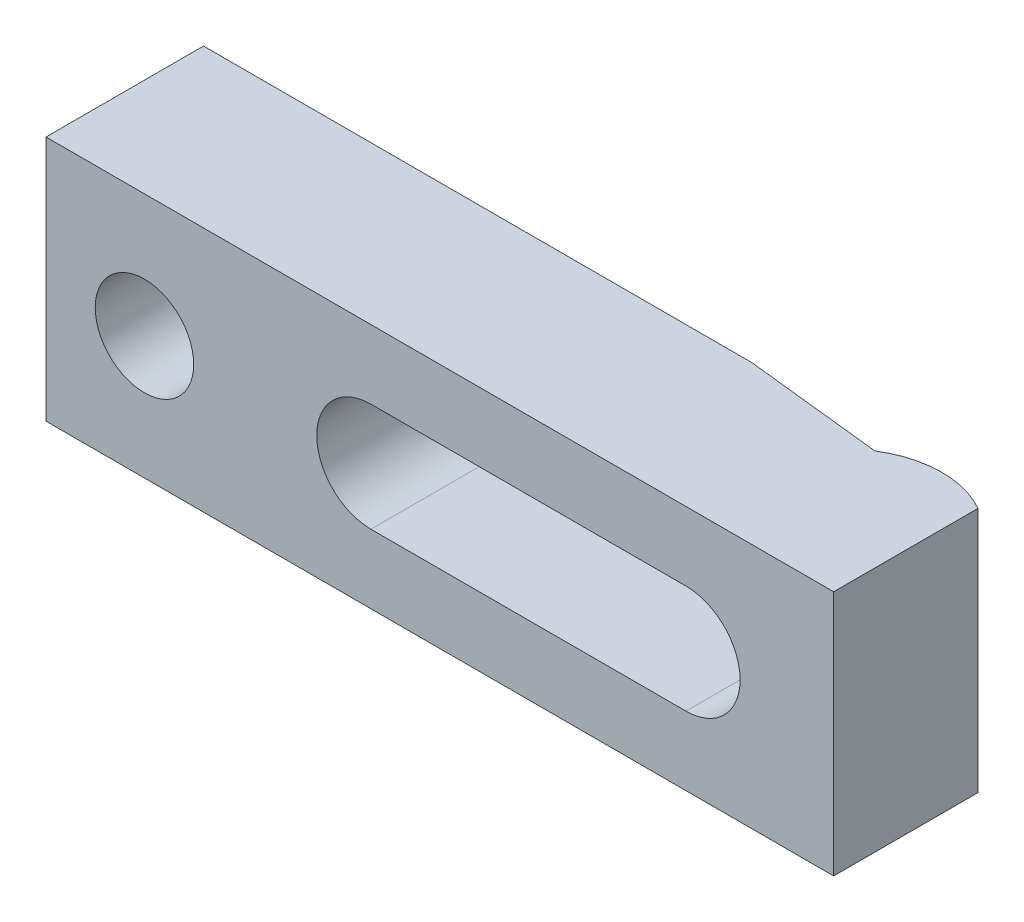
ISO-10303-21;
HEADER;
FILE_DESCRIPTION(('STEP AP214'),'2;1');
FILE_NAME('part.step','',(''),(''),'','','');
FILE_SCHEMA(('AUTOMOTIVE_DESIGN { 1 0 10303 214 1 1 1 1 }'));
ENDSEC;
DATA;
#1=APPLICATION_CONTEXT('core data for automotive mechanical design processes');
#2=APPLICATION_PROTOCOL_DEFINITION('international standard','automotive_design',2000,#1);
#3=PRODUCT_CONTEXT('',#1,'mechanical');
#4=PRODUCT('Part','Part','',(#3));
#5=PRODUCT_RELATED_PRODUCT_CATEGORY('part','',(#4));
#6=PRODUCT_DEFINITION_FORMATION('','',#4);
#7=PRODUCT_DEFINITION_CONTEXT('part definition',#1,'design');
#8=PRODUCT_DEFINITION('design','',#6,#7);
#9=PRODUCT_DEFINITION_SHAPE('','',#8);
#10=(LENGTH_UNIT() NAMED_UNIT(*) SI_UNIT(.MILLI.,.METRE.));
#11=(NAMED_UNIT(*) PLANE_ANGLE_UNIT() SI_UNIT($,.RADIAN.));
#12=(NAMED_UNIT(*) SI_UNIT($,.STERADIAN.) SOLID_ANGLE_UNIT());
#13=UNCERTAINTY_MEASURE_WITH_UNIT(LENGTH_MEASURE(1.E-05),#10,'distance_accuracy_value','');
#14=(GEOMETRIC_REPRESENTATION_CONTEXT(3) GLOBAL_UNCERTAINTY_ASSIGNED_CONTEXT((#13)) GLOBAL_UNIT_ASSIGNED_CONTEXT((#10,
#11,#12)) REPRESENTATION_CONTEXT('',''));
#15=CARTESIAN_POINT('',(0.,0.,0.));
#16=DIRECTION('',(0.,0.,1.));
#17=DIRECTION('',(1.,0.,0.));
#18=AXIS2_PLACEMENT_3D('',#15,#16,#17);
#19=CARTESIAN_POINT('',(-65.,12.5,0.));
#20=DIRECTION('',(0.,0.,-1.));
#21=DIRECTION('',(-1.,0.,0.));
#22=AXIS2_PLACEMENT_3D('',#19,#20,#21);
#23=PLANE('',#22);
#24=DIRECTION('',(1.,0.,0.));
#25=VECTOR('',#24,1.);
#26=CARTESIAN_POINT('',(-32.,5.5,0.));
#27=LINE('',#26,#25);
#28=CARTESIAN_POINT('',(-65.,5.5,0.));
#29=VERTEX_POINT('',#28);
#30=CARTESIAN_POINT('',(-9.3,5.5,0.));
#31=VERTEX_POINT('',#30);
#32=EDGE_CURVE('E127',#29,#31,#27,.T.);
#33=ORIENTED_EDGE('',*,*,#32,.F.);
#34=DIRECTION('',(0.,-1.,0.));
#35=VECTOR('',#34,1.);
#36=CARTESIAN_POINT('',(-65.,12.5,0.));
#37=LINE('',#36,#35);
#38=CARTESIAN_POINT('',(-65.,12.5,0.));
#39=VERTEX_POINT('',#38);
#40=EDGE_CURVE('E144',#39,#29,#37,.T.);
#41=ORIENTED_EDGE('',*,*,#40,.F.);
#42=DIRECTION('',(1.,0.,0.));
#43=VECTOR('',#42,1.);
#44=CARTESIAN_POINT('',(-65.,12.5,0.));
#45=LINE('',#44,#43);
#46=CARTESIAN_POINT('',(-9.3,12.5,0.));
#47=VERTEX_POINT('',#46);
#48=EDGE_CURVE('E262',#39,#47,#45,.T.);
#49=ORIENTED_EDGE('',*,*,#48,.T.);
#50=DIRECTION('',(0.,-1.,0.));
#51=VECTOR('',#50,1.);
#52=CARTESIAN_POINT('',(-9.3,12.5,0.));
#53=LINE('',#52,#51);
#54=EDGE_CURVE('E152',#47,#31,#53,.T.);
#55=ORIENTED_EDGE('',*,*,#54,.T.);
#56=EDGE_LOOP('',(#33,#41,#49,#55));
#57=FACE_BOUND('',#56,.T.);
#58=ADVANCED_FACE('F14',(#57),#23,.T.);
#59=CARTESIAN_POINT('',(-65.,12.5,16.));
#60=DIRECTION('',(-1.,0.,0.));
#61=DIRECTION('',(0.,0.,1.));
#62=AXIS2_PLACEMENT_3D('',#59,#60,#61);
#63=PLANE('',#62);
#64=ORIENTED_EDGE('',*,*,#40,.T.);
#65=DIRECTION('',(0.,0.,1.));
#66=VECTOR('',#65,1.);
#67=CARTESIAN_POINT('',(-65.,5.5,16.));
#68=LINE('',#67,#66);
#69=CARTESIAN_POINT('',(-65.,5.5,5.));
#70=VERTEX_POINT('',#69);
#71=EDGE_CURVE('E138',#29,#70,#68,.T.);
#72=ORIENTED_EDGE('',*,*,#71,.T.);
#73=DIRECTION('',(0.,-1.,0.));
#74=VECTOR('',#73,1.);
#75=CARTESIAN_POINT('',(-65.,12.5,5.));
#76=LINE('',#75,#74);
#77=CARTESIAN_POINT('',(-65.,-5.5,5.));
#78=VERTEX_POINT('',#77);
#79=EDGE_CURVE('E137',#70,#78,#76,.T.);
#80=ORIENTED_EDGE('',*,*,#79,.T.);
#81=DIRECTION('',(0.,0.,1.));
#82=VECTOR('',#81,1.);
#83=CARTESIAN_POINT('',(-65.,-5.5,16.));
#84=LINE('',#83,#82);
#85=CARTESIAN_POINT('',(-65.,-5.5,0.));
#86=VERTEX_POINT('',#85);
#87=EDGE_CURVE('E120',#86,#78,#84,.T.);
#88=ORIENTED_EDGE('',*,*,#87,.F.);
#89=CARTESIAN_POINT('',(-65.,-12.5,0.));
#90=VERTEX_POINT('',#89);
#91=EDGE_CURVE('E134',#86,#90,#37,.T.);
#92=ORIENTED_EDGE('',*,*,#91,.T.);
#93=DIRECTION('',(0.,0.,-1.));
#94=VECTOR('',#93,1.);
#95=CARTESIAN_POINT('',(-65.,-12.5,16.));
#96=LINE('',#95,#94);
#97=CARTESIAN_POINT('',(-65.,-12.5,16.));
#98=VERTEX_POINT('',#97);
#99=EDGE_CURVE('E285',#98,#90,#96,.T.);
#100=ORIENTED_EDGE('',*,*,#99,.F.);
#101=DIRECTION('',(0.,-1.,0.));
#102=VECTOR('',#101,1.);
#103=CARTESIAN_POINT('',(-65.,12.5,16.));
#104=LINE('',#103,#102);
#105=CARTESIAN_POINT('',(-65.,12.5,16.));
#106=VERTEX_POINT('',#105);
#107=EDGE_CURVE('E145',#106,#98,#104,.T.);
#108=ORIENTED_EDGE('',*,*,#107,.F.);
#109=DIRECTION('',(0.,0.,-1.));
#110=VECTOR('',#109,1.);
#111=CARTESIAN_POINT('',(-65.,12.5,16.));
#112=LINE('',#111,#110);
#113=EDGE_CURVE('E258',#106,#39,#112,.T.);
#114=ORIENTED_EDGE('',*,*,#113,.T.);
#115=EDGE_LOOP('',(#64,#72,#80,#88,#92,#100,#108,#114));
#116=FACE_BOUND('',#115,.T.);
#117=ADVANCED_FACE('F132',(#116),#63,.T.);
#118=CARTESIAN_POINT('',(-32.,0.,16.));
#119=DIRECTION('',(0.,0.,-1.));
#120=DIRECTION('',(-1.,0.,0.));
#121=AXIS2_PLACEMENT_3D('',#118,#119,#120);
#122=CYLINDRICAL_SURFACE('',#121,5.5);
#123=DIRECTION('',(0.,0.,-1.));
#124=VECTOR('',#123,1.);
#125=CARTESIAN_POINT('',(-32.,-5.5,16.));
#126=LINE('',#125,#124);
#127=CARTESIAN_POINT('',(-32.,-5.5,16.));
#128=VERTEX_POINT('',#127);
#129=CARTESIAN_POINT('',(-32.,-5.5,5.));
#130=VERTEX_POINT('',#129);
#131=EDGE_CURVE('E176',#128,#130,#126,.T.);
#132=ORIENTED_EDGE('',*,*,#131,.T.);
#133=CARTESIAN_POINT('',(-32.,0.,5.));
#134=DIRECTION('',(0.,0.,-1.));
#135=DIRECTION('',(-1.,0.,0.));
#136=AXIS2_PLACEMENT_3D('',#133,#134,#135);
#137=CIRCLE('',#136,5.5);
#138=CARTESIAN_POINT('',(-32.,5.5,5.));
#139=VERTEX_POINT('',#138);
#140=EDGE_CURVE('E300',#130,#139,#137,.T.);
#141=ORIENTED_EDGE('',*,*,#140,.T.);
#142=DIRECTION('',(0.,0.,-1.));
#143=VECTOR('',#142,1.);
#144=CARTESIAN_POINT('',(-32.,5.5,16.));
#145=LINE('',#144,#143);
#146=CARTESIAN_POINT('',(-32.,5.5,16.));
#147=VERTEX_POINT('',#146);
#148=EDGE_CURVE('E178',#147,#139,#145,.T.);
#149=ORIENTED_EDGE('',*,*,#148,.F.);
#150=CARTESIAN_POINT('',(-32.,0.,16.));
#151=DIRECTION('',(0.,0.,1.));
#152=DIRECTION('',(1.,0.,0.));
#153=AXIS2_PLACEMENT_3D('',#150,#151,#152);
#154=CIRCLE('',#153,5.5);
#155=EDGE_CURVE('E38',#147,#128,#154,.T.);
#156=ORIENTED_EDGE('',*,*,#155,.T.);
#157=EDGE_LOOP('',(#132,#141,#149,#156));
#158=FACE_BOUND('',#157,.T.);
#159=ADVANCED_FACE('F215',(#158),#122,.F.);
#160=CARTESIAN_POINT('',(-55.,0.,16.));
#161=DIRECTION('',(0.,0.,-1.));
#162=DIRECTION('',(-1.,0.,0.));
#163=AXIS2_PLACEMENT_3D('',#160,#161,#162);
#164=CYLINDRICAL_SURFACE('',#163,5.);
#165=CARTESIAN_POINT('',(-55.,0.,16.));
#166=DIRECTION('',(0.,0.,1.));
#167=DIRECTION('',(1.,0.,0.));
#168=AXIS2_PLACEMENT_3D('',#165,#166,#167);
#169=CIRCLE('',#168,5.);
#170=CARTESIAN_POINT('',(-50.,0.,16.));
#171=VERTEX_POINT('',#170);
#172=EDGE_CURVE('E254',#171,#171,#169,.T.);
#173=ORIENTED_EDGE('',*,*,#172,.T.);
#174=EDGE_LOOP('',(#173));
#175=FACE_BOUND('',#174,.T.);
#176=CARTESIAN_POINT('',(-55.,0.,5.));
#177=DIRECTION('',(0.,0.,-1.));
#178=DIRECTION('',(-1.,0.,0.));
#179=AXIS2_PLACEMENT_3D('',#176,#177,#178);
#180=CIRCLE('',#179,5.);
#181=CARTESIAN_POINT('',(-60.,0.,5.));
#182=VERTEX_POINT('',#181);
#183=EDGE_CURVE('E18',#182,#182,#180,.T.);
#184=ORIENTED_EDGE('',*,*,#183,.T.);
#185=EDGE_LOOP('',(#184));
#186=FACE_BOUND('',#185,.T.);
#187=ADVANCED_FACE('F210',(#175,#186),#164,.F.);
#188=CARTESIAN_POINT('',(15.,12.5,16.));
#189=DIRECTION('',(0.,0.,1.));
#190=DIRECTION('',(1.,0.,0.));
#191=AXIS2_PLACEMENT_3D('',#188,#189,#190);
#192=PLANE('',#191);
#193=DIRECTION('',(1.,0.,0.));
#194=VECTOR('',#193,1.);
#195=CARTESIAN_POINT('',(-32.,5.5,16.));
#196=LINE('',#195,#194);
#197=CARTESIAN_POINT('',(0.,5.5,16.));
#198=VERTEX_POINT('',#197);
#199=EDGE_CURVE('E294',#147,#198,#196,.T.);
#200=ORIENTED_EDGE('',*,*,#199,.T.);
#201=CARTESIAN_POINT('',(0.,0.,16.));
#202=DIRECTION('',(0.,0.,1.));
#203=DIRECTION('',(1.,0.,0.));
#204=AXIS2_PLACEMENT_3D('',#201,#202,#203);
#205=CIRCLE('',#204,5.5);
#206=CARTESIAN_POINT('',(0.,-5.5,16.));
#207=VERTEX_POINT('',#206);
#208=EDGE_CURVE('E126',#207,#198,#205,.T.);
#209=ORIENTED_EDGE('',*,*,#208,.F.);
#210=DIRECTION('',(-1.,0.,0.));
#211=VECTOR('',#210,1.);
#212=CARTESIAN_POINT('',(0.,-5.5,16.));
#213=LINE('',#212,#211);
#214=EDGE_CURVE('E174',#207,#128,#213,.T.);
#215=ORIENTED_EDGE('',*,*,#214,.T.);
#216=ORIENTED_EDGE('',*,*,#155,.F.);
#217=EDGE_LOOP('',(#200,#209,#215,#216));
#218=FACE_BOUND('',#217,.T.);
#219=DIRECTION('',(0.,-1.,0.));
#220=VECTOR('',#219,1.);
#221=CARTESIAN_POINT('',(15.,12.5,16.));
#222=LINE('',#221,#220);
#223=CARTESIAN_POINT('',(15.,12.5,16.));
#224=VERTEX_POINT('',#223);
#225=CARTESIAN_POINT('',(15.,-12.5,16.));
#226=VERTEX_POINT('',#225);
#227=EDGE_CURVE('E161',#224,#226,#222,.T.);
#228=ORIENTED_EDGE('',*,*,#227,.F.);
#229=DIRECTION('',(-1.,0.,0.));
#230=VECTOR('',#229,1.);
#231=CARTESIAN_POINT('',(15.,12.5,16.));
#232=LINE('',#231,#230);
#233=EDGE_CURVE('E263',#224,#106,#232,.T.);
#234=ORIENTED_EDGE('',*,*,#233,.T.);
#235=ORIENTED_EDGE('',*,*,#107,.T.);
#236=DIRECTION('',(-1.,0.,0.));
#237=VECTOR('',#236,1.);
#238=CARTESIAN_POINT('',(15.,-12.5,16.));
#239=LINE('',#238,#237);
#240=EDGE_CURVE('E198',#226,#98,#239,.T.);
#241=ORIENTED_EDGE('',*,*,#240,.F.);
#242=EDGE_LOOP('',(#228,#234,#235,#241));
#243=FACE_BOUND('',#242,.T.);
#244=ORIENTED_EDGE('',*,*,#172,.F.);
#245=EDGE_LOOP('',(#244));
#246=FACE_BOUND('',#245,.T.);
#247=ADVANCED_FACE('F228',(#218,#243,#246),#192,.T.);
#248=ORIENTED_EDGE('',*,*,#91,.F.);
#249=DIRECTION('',(-1.,0.,0.));
#250=VECTOR('',#249,1.);
#251=CARTESIAN_POINT('',(0.,-5.5,0.));
#252=LINE('',#251,#250);
#253=CARTESIAN_POINT('',(-9.3,-5.5,0.));
#254=VERTEX_POINT('',#253);
#255=EDGE_CURVE('E115',#254,#86,#252,.T.);
#256=ORIENTED_EDGE('',*,*,#255,.F.);
#257=CARTESIAN_POINT('',(-9.3,-12.5,0.));
#258=VERTEX_POINT('',#257);
#259=EDGE_CURVE('E147',#254,#258,#53,.T.);
#260=ORIENTED_EDGE('',*,*,#259,.T.);
#261=DIRECTION('',(1.,0.,0.));
#262=VECTOR('',#261,1.);
#263=CARTESIAN_POINT('',(-65.,-12.5,0.));
#264=LINE('',#263,#262);
#265=EDGE_CURVE('E143',#90,#258,#264,.T.);
#266=ORIENTED_EDGE('',*,*,#265,.F.);
#267=EDGE_LOOP('',(#248,#256,#260,#266));
#268=FACE_BOUND('',#267,.T.);
#269=ADVANCED_FACE('F141',(#268),#23,.T.);
#270=CARTESIAN_POINT('',(10.,12.5,10.));
#271=DIRECTION('',(0.,-1.,0.));
#272=DIRECTION('',(0.,0.,-1.));
#273=AXIS2_PLACEMENT_3D('',#270,#271,#272);
#274=CYLINDRICAL_SURFACE('',#273,10.);
#275=CARTESIAN_POINT('',(4.49084420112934,3.1752666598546,1.65439023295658));
#276=CARTESIAN_POINT('',(4.56984809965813,3.06359534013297,1.60224264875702));
#277=CARTESIAN_POINT('',(4.64546895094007,2.94773997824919,1.55392976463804));
#278=CARTESIAN_POINT('',(4.78884780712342,2.70855450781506,1.46471759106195));
#279=CARTESIAN_POINT('',(4.85660597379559,2.58522455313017,1.42381814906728));
#280=CARTESIAN_POINT('',(4.98308144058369,2.33214786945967,1.34922483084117));
#281=CARTESIAN_POINT('',(5.04181070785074,2.2024099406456,1.31552139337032));
#282=CARTESIAN_POINT('',(5.14945828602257,1.93740120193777,1.25494057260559));
#283=CARTESIAN_POINT('',(5.19837748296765,1.80213089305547,1.22806257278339));
#284=CARTESIAN_POINT('',(5.28309654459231,1.53534952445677,1.18223384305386));
#285=CARTESIAN_POINT('',(5.31950515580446,1.40409594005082,1.1629057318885));
#286=CARTESIAN_POINT('',(5.38259832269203,1.13853677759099,1.1297759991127));
#287=CARTESIAN_POINT('',(5.4092794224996,1.00423013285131,1.11597634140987));
#288=CARTESIAN_POINT('',(5.45256455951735,0.733683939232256,1.09374247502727));
#289=CARTESIAN_POINT('',(5.46917715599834,0.597446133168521,1.08530370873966));
#290=CARTESIAN_POINT('',(5.49217577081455,0.323825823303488,1.07365206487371));
#291=CARTESIAN_POINT('',(5.49855713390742,0.186442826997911,1.07044156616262));
#292=CARTESIAN_POINT('',(5.50100923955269,-0.0887714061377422,1.06920584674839));
#293=CARTESIAN_POINT('',(5.49705497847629,-0.226602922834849,1.07119320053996));
#294=CARTESIAN_POINT('',(5.47883194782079,-0.501343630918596,1.08040678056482));
#295=CARTESIAN_POINT('',(5.46456785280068,-0.638253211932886,1.0876306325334));
#296=CARTESIAN_POINT('',(5.42587847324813,-0.910352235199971,1.10742533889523));
#297=CARTESIAN_POINT('',(5.40144496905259,-1.04554019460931,1.12000051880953));
#298=CARTESIAN_POINT('',(5.34271514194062,-1.3130660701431,1.15066142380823));
#299=CARTESIAN_POINT('',(5.30842257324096,-1.44540505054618,1.16874505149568));
#300=CARTESIAN_POINT('',(5.23037882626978,-1.70636668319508,1.21064993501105));
#301=CARTESIAN_POINT('',(5.18662550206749,-1.83498848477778,1.23447249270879));
#302=CARTESIAN_POINT('',(5.09021998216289,-2.0875676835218,1.28810589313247));
#303=CARTESIAN_POINT('',(5.03756762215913,-2.21152499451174,1.3179168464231));
#304=CARTESIAN_POINT('',(4.92401628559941,-2.45397026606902,1.38381149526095));
#305=CARTESIAN_POINT('',(4.86311213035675,-2.57245472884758,1.41989913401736));
#306=CARTESIAN_POINT('',(4.73394184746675,-2.80309686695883,1.49856949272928));
#307=CARTESIAN_POINT('',(4.66567519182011,-2.91525408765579,1.54115267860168));
#308=CARTESIAN_POINT('',(4.59416135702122,-3.0238520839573,1.58709868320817));
#309=B_SPLINE_CURVE_WITH_KNOTS('',3,(#275,#276,#277,#278,#279,#280,#281,#282,#283,#284,#285,
#286,#287,#288,#289,#290,#291,#292,#293,#294,#295,#296,#297,#298,#299,#300,#301,#302,#303,#304,
#305,#306,#307,#308),.UNSPECIFIED.,.F.,.F.,(4,2,2,2,2,2,2,2,2,2,2,2,2,2,2,2,4),(0.,
0.439039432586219,0.878069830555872,1.31651321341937,1.75491697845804,2.16715557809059,
2.57954049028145,2.99157433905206,3.4037956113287,3.81701503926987,4.23004722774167,
4.64341390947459,5.05662339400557,5.46992670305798,5.88323764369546,6.29680918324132,
6.71041040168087),.UNSPECIFIED.);
#310=CARTESIAN_POINT('',(4.7,2.85657137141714,1.52002358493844));
#311=VERTEX_POINT('',#310);
#312=CARTESIAN_POINT('',(4.7,-2.85657137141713,1.52002358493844));
#313=VERTEX_POINT('',#312);
#314=EDGE_CURVE('E170',#311,#313,#309,.T.);
#315=ORIENTED_EDGE('',*,*,#314,.F.);
#316=DIRECTION('',(0.,-1.,0.));
#317=VECTOR('',#316,1.);
#318=CARTESIAN_POINT('',(4.7,12.5,1.52002358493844));
#319=LINE('',#318,#317);
#320=CARTESIAN_POINT('',(4.7,12.5,1.52002358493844));
#321=VERTEX_POINT('',#320);
#322=EDGE_CURVE('E156',#321,#311,#319,.T.);
#323=ORIENTED_EDGE('',*,*,#322,.F.);
#324=CARTESIAN_POINT('',(10.,12.5,10.));
#325=DIRECTION('',(0.,1.,0.));
#326=DIRECTION('',(0.,0.,1.));
#327=AXIS2_PLACEMENT_3D('',#324,#325,#326);
#328=CIRCLE('',#327,10.);
#329=CARTESIAN_POINT('',(15.,12.5,1.33974596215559));
#330=VERTEX_POINT('',#329);
#331=EDGE_CURVE('E270',#330,#321,#328,.T.);
#332=ORIENTED_EDGE('',*,*,#331,.F.);
#333=DIRECTION('',(0.,-1.,0.));
#334=VECTOR('',#333,1.);
#335=CARTESIAN_POINT('',(15.,12.5,1.33974596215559));
#336=LINE('',#335,#334);
#337=CARTESIAN_POINT('',(15.,-12.5,1.33974596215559));
#338=VERTEX_POINT('',#337);
#339=EDGE_CURVE('E159',#330,#338,#336,.T.);
#340=ORIENTED_EDGE('',*,*,#339,.T.);
#341=CARTESIAN_POINT('',(10.,-12.5,10.));
#342=DIRECTION('',(0.,1.,0.));
#343=DIRECTION('',(0.,0.,1.));
#344=AXIS2_PLACEMENT_3D('',#341,#342,#343);
#345=CIRCLE('',#344,10.);
#346=CARTESIAN_POINT('',(4.7,-12.5,1.52002358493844));
#347=VERTEX_POINT('',#346);
#348=EDGE_CURVE('E275',#338,#347,#345,.T.);
#349=ORIENTED_EDGE('',*,*,#348,.T.);
#350=EDGE_CURVE('E155',#313,#347,#319,.T.);
#351=ORIENTED_EDGE('',*,*,#350,.F.);
#352=EDGE_LOOP('',(#315,#323,#332,#340,#349,#351));
#353=FACE_BOUND('',#352,.T.);
#354=ADVANCED_FACE('F201',(#353),#274,.T.);
#355=CARTESIAN_POINT('',(4.7,12.5,1.52002358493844));
#356=DIRECTION('',(-0.107938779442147,0.,0.994157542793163));
#357=DIRECTION('',(0.994157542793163,0.,0.107938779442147));
#358=AXIS2_PLACEMENT_3D('',#355,#356,#357);
#359=PLANE('',#358);
#360=CARTESIAN_POINT('',(0.,0.,1.00972995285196));
#361=DIRECTION('',(-0.107938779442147,0.,0.994157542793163));
#362=DIRECTION('',(-0.994157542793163,0.,-0.107938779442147));
#363=AXIS2_PLACEMENT_3D('',#360,#361,#362);
#364=ELLIPSE('',#363,5.532322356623,5.5);
#365=CARTESIAN_POINT('',(0.,5.5,1.00972995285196));
#366=VERTEX_POINT('',#365);
#367=EDGE_CURVE('E9',#366,#311,#364,.F.);
#368=ORIENTED_EDGE('',*,*,#367,.F.);
#369=DIRECTION('',(-0.994157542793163,0.,-0.107938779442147));
#370=VECTOR('',#369,1.);
#371=CARTESIAN_POINT('',(4.7,5.5,1.52002358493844));
#372=LINE('',#371,#370);
#373=EDGE_CURVE('E190',#366,#31,#372,.T.);
#374=ORIENTED_EDGE('',*,*,#373,.T.);
#375=ORIENTED_EDGE('',*,*,#54,.F.);
#376=DIRECTION('',(-0.994157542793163,0.,-0.107938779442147));
#377=VECTOR('',#376,1.);
#378=CARTESIAN_POINT('',(4.7,12.5,1.52002358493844));
#379=LINE('',#378,#377);
#380=EDGE_CURVE('E268',#321,#47,#379,.T.);
#381=ORIENTED_EDGE('',*,*,#380,.F.);
#382=ORIENTED_EDGE('',*,*,#322,.T.);
#383=EDGE_LOOP('',(#368,#374,#375,#381,#382));
#384=FACE_BOUND('',#383,.T.);
#385=ADVANCED_FACE('F235',(#384),#359,.F.);
#386=CARTESIAN_POINT('',(0.,-5.5,1.00972995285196));
#387=VERTEX_POINT('',#386);
#388=EDGE_CURVE('E23',#313,#387,#364,.F.);
#389=ORIENTED_EDGE('',*,*,#388,.F.);
#390=ORIENTED_EDGE('',*,*,#350,.T.);
#391=DIRECTION('',(-0.994157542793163,0.,-0.107938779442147));
#392=VECTOR('',#391,1.);
#393=CARTESIAN_POINT('',(4.7,-12.5,1.52002358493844));
#394=LINE('',#393,#392);
#395=EDGE_CURVE('E279',#347,#258,#394,.T.);
#396=ORIENTED_EDGE('',*,*,#395,.T.);
#397=ORIENTED_EDGE('',*,*,#259,.F.);
#398=DIRECTION('',(0.994157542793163,0.,0.107938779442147));
#399=VECTOR('',#398,1.);
#400=CARTESIAN_POINT('',(4.7,-5.5,1.52002358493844));
#401=LINE('',#400,#399);
#402=EDGE_CURVE('E122',#254,#387,#401,.T.);
#403=ORIENTED_EDGE('',*,*,#402,.T.);
#404=EDGE_LOOP('',(#389,#390,#396,#397,#403));
#405=FACE_BOUND('',#404,.T.);
#406=ADVANCED_FACE('F237',(#405),#359,.F.);
#407=CARTESIAN_POINT('',(15.,12.5,16.));
#408=DIRECTION('',(-1.,0.,0.));
#409=DIRECTION('',(0.,0.,1.));
#410=AXIS2_PLACEMENT_3D('',#407,#408,#409);
#411=PLANE('',#410);
#412=ORIENTED_EDGE('',*,*,#339,.F.);
#413=DIRECTION('',(0.,0.,-1.));
#414=VECTOR('',#413,1.);
#415=CARTESIAN_POINT('',(15.,12.5,16.));
#416=LINE('',#415,#414);
#417=EDGE_CURVE('E148',#224,#330,#416,.T.);
#418=ORIENTED_EDGE('',*,*,#417,.F.);
#419=ORIENTED_EDGE('',*,*,#227,.T.);
#420=DIRECTION('',(0.,0.,-1.));
#421=VECTOR('',#420,1.);
#422=CARTESIAN_POINT('',(15.,-12.5,16.));
#423=LINE('',#422,#421);
#424=EDGE_CURVE('E199',#226,#338,#423,.T.);
#425=ORIENTED_EDGE('',*,*,#424,.T.);
#426=EDGE_LOOP('',(#412,#418,#419,#425));
#427=FACE_BOUND('',#426,.T.);
#428=ADVANCED_FACE('F16',(#427),#411,.F.);
#429=CARTESIAN_POINT('',(10.,12.5,10.));
#430=DIRECTION('',(0.,1.,0.));
#431=DIRECTION('',(0.,0.,1.));
#432=AXIS2_PLACEMENT_3D('',#429,#430,#431);
#433=PLANE('',#432);
#434=ORIENTED_EDGE('',*,*,#233,.F.);
#435=ORIENTED_EDGE('',*,*,#417,.T.);
#436=ORIENTED_EDGE('',*,*,#331,.T.);
#437=ORIENTED_EDGE('',*,*,#380,.T.);
#438=ORIENTED_EDGE('',*,*,#48,.F.);
#439=ORIENTED_EDGE('',*,*,#113,.F.);
#440=EDGE_LOOP('',(#434,#435,#436,#437,#438,#439));
#441=FACE_BOUND('',#440,.T.);
#442=ADVANCED_FACE('F223',(#441),#433,.T.);
#443=CARTESIAN_POINT('',(10.,-12.5,10.));
#444=DIRECTION('',(0.,1.,0.));
#445=DIRECTION('',(0.,0.,1.));
#446=AXIS2_PLACEMENT_3D('',#443,#444,#445);
#447=PLANE('',#446);
#448=ORIENTED_EDGE('',*,*,#240,.T.);
#449=ORIENTED_EDGE('',*,*,#99,.T.);
#450=ORIENTED_EDGE('',*,*,#265,.T.);
#451=ORIENTED_EDGE('',*,*,#395,.F.);
#452=ORIENTED_EDGE('',*,*,#348,.F.);
#453=ORIENTED_EDGE('',*,*,#424,.F.);
#454=EDGE_LOOP('',(#448,#449,#450,#451,#452,#453));
#455=FACE_BOUND('',#454,.T.);
#456=ADVANCED_FACE('F209',(#455),#447,.F.);
#457=CARTESIAN_POINT('',(0.,0.,16.));
#458=DIRECTION('',(0.,0.,-1.));
#459=DIRECTION('',(-1.,0.,0.));
#460=AXIS2_PLACEMENT_3D('',#457,#458,#459);
#461=CYLINDRICAL_SURFACE('',#460,5.5);
#462=ORIENTED_EDGE('',*,*,#367,.T.);
#463=ORIENTED_EDGE('',*,*,#314,.T.);
#464=ORIENTED_EDGE('',*,*,#388,.T.);
#465=DIRECTION('',(0.,0.,-1.));
#466=VECTOR('',#465,1.);
#467=CARTESIAN_POINT('',(0.,-5.5,16.));
#468=LINE('',#467,#466);
#469=EDGE_CURVE('E167',#207,#387,#468,.T.);
#470=ORIENTED_EDGE('',*,*,#469,.F.);
#471=ORIENTED_EDGE('',*,*,#208,.T.);
#472=DIRECTION('',(0.,0.,-1.));
#473=VECTOR('',#472,1.);
#474=CARTESIAN_POINT('',(0.,5.5,16.));
#475=LINE('',#474,#473);
#476=EDGE_CURVE('E186',#198,#366,#475,.T.);
#477=ORIENTED_EDGE('',*,*,#476,.T.);
#478=EDGE_LOOP('',(#462,#463,#464,#470,#471,#477));
#479=FACE_BOUND('',#478,.T.);
#480=ADVANCED_FACE('F165',(#479),#461,.F.);
#481=CARTESIAN_POINT('',(-32.,5.5,16.));
#482=DIRECTION('',(0.,1.,0.));
#483=DIRECTION('',(0.,0.,1.));
#484=AXIS2_PLACEMENT_3D('',#481,#482,#483);
#485=PLANE('',#484);
#486=ORIENTED_EDGE('',*,*,#32,.T.);
#487=ORIENTED_EDGE('',*,*,#373,.F.);
#488=ORIENTED_EDGE('',*,*,#476,.F.);
#489=ORIENTED_EDGE('',*,*,#199,.F.);
#490=ORIENTED_EDGE('',*,*,#148,.T.);
#491=DIRECTION('',(-1.,0.,0.));
#492=VECTOR('',#491,1.);
#493=CARTESIAN_POINT('',(-5.,5.5,5.));
#494=LINE('',#493,#492);
#495=EDGE_CURVE('E30',#139,#70,#494,.T.);
#496=ORIENTED_EDGE('',*,*,#495,.T.);
#497=ORIENTED_EDGE('',*,*,#71,.F.);
#498=EDGE_LOOP('',(#486,#487,#488,#489,#490,#496,#497));
#499=FACE_BOUND('',#498,.T.);
#500=ADVANCED_FACE('F208',(#499),#485,.F.);
#501=CARTESIAN_POINT('',(0.,-5.5,16.));
#502=DIRECTION('',(0.,-1.,0.));
#503=DIRECTION('',(1.,0.,0.));
#504=AXIS2_PLACEMENT_3D('',#501,#502,#503);
#505=PLANE('',#504);
#506=ORIENTED_EDGE('',*,*,#469,.T.);
#507=ORIENTED_EDGE('',*,*,#402,.F.);
#508=ORIENTED_EDGE('',*,*,#255,.T.);
#509=ORIENTED_EDGE('',*,*,#87,.T.);
#510=DIRECTION('',(-1.,0.,0.));
#511=VECTOR('',#510,1.);
#512=CARTESIAN_POINT('',(-5.,-5.5,5.));
#513=LINE('',#512,#511);
#514=EDGE_CURVE('E302',#130,#78,#513,.T.);
#515=ORIENTED_EDGE('',*,*,#514,.F.);
#516=ORIENTED_EDGE('',*,*,#131,.F.);
#517=ORIENTED_EDGE('',*,*,#214,.F.);
#518=EDGE_LOOP('',(#506,#507,#508,#509,#515,#516,#517));
#519=FACE_BOUND('',#518,.T.);
#520=ADVANCED_FACE('F118',(#519),#505,.F.);
#521=CARTESIAN_POINT('',(-5.,-5.5,5.));
#522=DIRECTION('',(0.,0.,-1.));
#523=DIRECTION('',(-1.,0.,0.));
#524=AXIS2_PLACEMENT_3D('',#521,#522,#523);
#525=PLANE('',#524);
#526=ORIENTED_EDGE('',*,*,#183,.F.);
#527=EDGE_LOOP('',(#526));
#528=FACE_BOUND('',#527,.T.);
#529=ORIENTED_EDGE('',*,*,#495,.F.);
#530=ORIENTED_EDGE('',*,*,#140,.F.);
#531=ORIENTED_EDGE('',*,*,#514,.T.);
#532=ORIENTED_EDGE('',*,*,#79,.F.);
#533=EDGE_LOOP('',(#529,#530,#531,#532));
#534=FACE_BOUND('',#533,.T.);
#535=ADVANCED_FACE('F214',(#528,#534),#525,.T.);
#536=CLOSED_SHELL('',(#58,#117,#159,#187,#247,#269,#354,#385,#406,#428,#442,#456,#480,#500,#520,#535));
#537=MANIFOLD_SOLID_BREP('B1',#536);
#538=ADVANCED_BREP_SHAPE_REPRESENTATION('',(#18,#537),#14);
#539=SHAPE_DEFINITION_REPRESENTATION(#9,#538);
ENDSEC;
END-ISO-10303-21;
